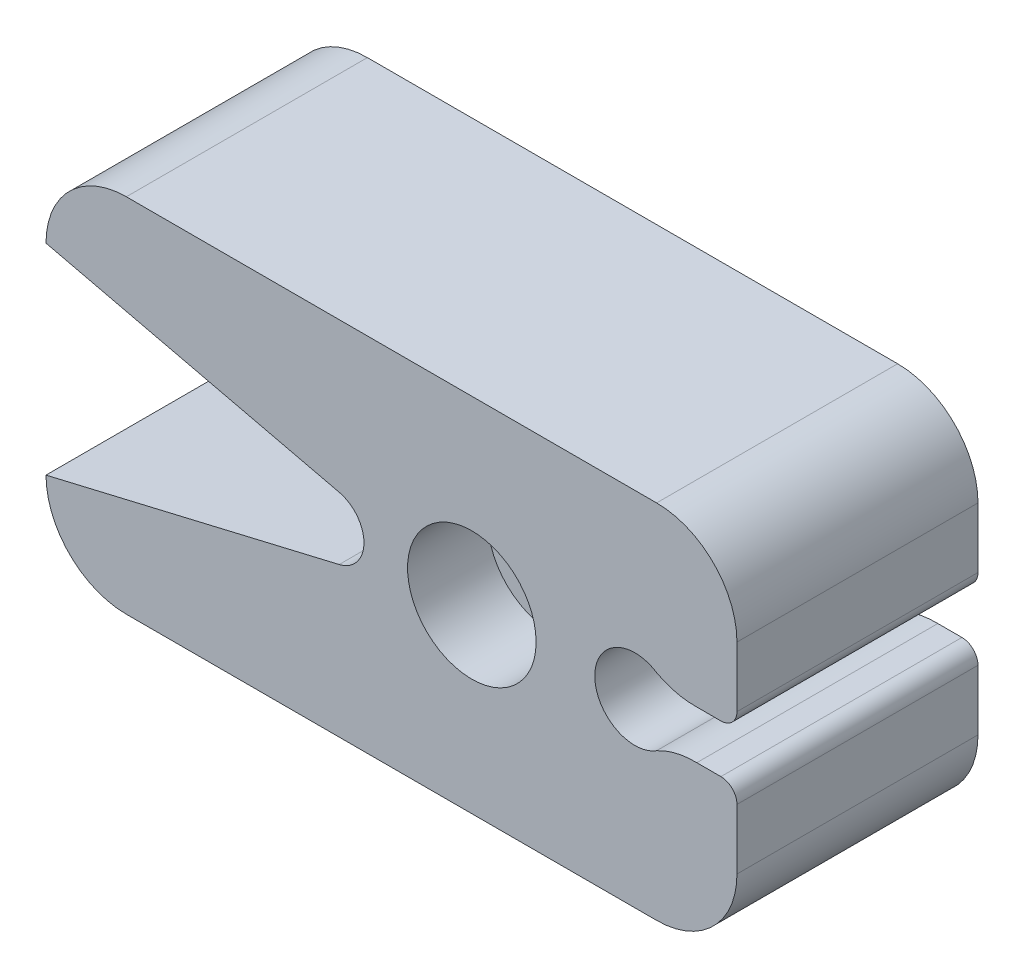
ISO-10303-21;
HEADER;
FILE_DESCRIPTION(('STEP AP214'),'2;1');
FILE_NAME('part.step','',(''),(''),'','','');
FILE_SCHEMA(('AUTOMOTIVE_DESIGN { 1 0 10303 214 1 1 1 1 }'));
ENDSEC;
DATA;
#1=APPLICATION_CONTEXT('core data for automotive mechanical design processes');
#2=APPLICATION_PROTOCOL_DEFINITION('international standard','automotive_design',2000,#1);
#3=PRODUCT_CONTEXT('',#1,'mechanical');
#4=PRODUCT('Part','Part','',(#3));
#5=PRODUCT_RELATED_PRODUCT_CATEGORY('part','',(#4));
#6=PRODUCT_DEFINITION_FORMATION('','',#4);
#7=PRODUCT_DEFINITION_CONTEXT('part definition',#1,'design');
#8=PRODUCT_DEFINITION('design','',#6,#7);
#9=PRODUCT_DEFINITION_SHAPE('','',#8);
#10=(LENGTH_UNIT() NAMED_UNIT(*) SI_UNIT(.MILLI.,.METRE.));
#11=(NAMED_UNIT(*) PLANE_ANGLE_UNIT() SI_UNIT($,.RADIAN.));
#12=(NAMED_UNIT(*) SI_UNIT($,.STERADIAN.) SOLID_ANGLE_UNIT());
#13=UNCERTAINTY_MEASURE_WITH_UNIT(LENGTH_MEASURE(1.E-05),#10,'distance_accuracy_value','');
#14=(GEOMETRIC_REPRESENTATION_CONTEXT(3) GLOBAL_UNCERTAINTY_ASSIGNED_CONTEXT((#13)) GLOBAL_UNIT_ASSIGNED_CONTEXT((#10,
#11,#12)) REPRESENTATION_CONTEXT('',''));
#15=CARTESIAN_POINT('',(0.,0.,0.));
#16=DIRECTION('',(0.,0.,1.));
#17=DIRECTION('',(1.,0.,0.));
#18=AXIS2_PLACEMENT_3D('',#15,#16,#17);
#19=CARTESIAN_POINT('',(33.,45.,30.));
#20=DIRECTION('',(-1.,0.,0.));
#21=DIRECTION('',(0.,0.,1.));
#22=AXIS2_PLACEMENT_3D('',#19,#20,#21);
#23=PLANE('',#22);
#24=DIRECTION('',(0.,1.,0.));
#25=VECTOR('',#24,1.);
#26=CARTESIAN_POINT('',(33.,45.,30.));
#27=LINE('',#26,#25);
#28=CARTESIAN_POINT('',(33.,27.5,30.));
#29=VERTEX_POINT('',#28);
#30=CARTESIAN_POINT('',(33.,35.,30.));
#31=VERTEX_POINT('',#30);
#32=EDGE_CURVE('E215',#29,#31,#27,.T.);
#33=ORIENTED_EDGE('',*,*,#32,.F.);
#34=DIRECTION('',(0.,0.,1.));
#35=VECTOR('',#34,1.);
#36=CARTESIAN_POINT('',(33.,27.5,30.));
#37=LINE('',#36,#35);
#38=CARTESIAN_POINT('',(33.,27.5,0.));
#39=VERTEX_POINT('',#38);
#40=EDGE_CURVE('E10',#29,#39,#37,.F.);
#41=ORIENTED_EDGE('',*,*,#40,.T.);
#42=DIRECTION('',(0.,1.,0.));
#43=VECTOR('',#42,1.);
#44=CARTESIAN_POINT('',(33.,45.,0.));
#45=LINE('',#44,#43);
#46=CARTESIAN_POINT('',(33.,35.,0.));
#47=VERTEX_POINT('',#46);
#48=EDGE_CURVE('E210',#39,#47,#45,.T.);
#49=ORIENTED_EDGE('',*,*,#48,.T.);
#50=DIRECTION('',(0.,0.,-1.));
#51=VECTOR('',#50,1.);
#52=CARTESIAN_POINT('',(33.,35.,30.));
#53=LINE('',#52,#51);
#54=EDGE_CURVE('E249',#47,#31,#53,.F.);
#55=ORIENTED_EDGE('',*,*,#54,.T.);
#56=EDGE_LOOP('',(#33,#41,#49,#55));
#57=FACE_BOUND('',#56,.T.);
#58=ADVANCED_FACE('F16',(#57),#23,.F.);
#59=CARTESIAN_POINT('',(33.,10.,0.));
#60=VERTEX_POINT('',#59);
#61=CARTESIAN_POINT('',(33.,17.5,0.));
#62=VERTEX_POINT('',#61);
#63=EDGE_CURVE('E224',#60,#62,#45,.T.);
#64=ORIENTED_EDGE('',*,*,#63,.T.);
#65=DIRECTION('',(0.,0.,1.));
#66=VECTOR('',#65,1.);
#67=CARTESIAN_POINT('',(33.,17.5,30.));
#68=LINE('',#67,#66);
#69=CARTESIAN_POINT('',(33.,17.5,30.));
#70=VERTEX_POINT('',#69);
#71=EDGE_CURVE('E270',#62,#70,#68,.T.);
#72=ORIENTED_EDGE('',*,*,#71,.T.);
#73=CARTESIAN_POINT('',(33.,10.,30.));
#74=VERTEX_POINT('',#73);
#75=EDGE_CURVE('E217',#74,#70,#27,.T.);
#76=ORIENTED_EDGE('',*,*,#75,.F.);
#77=DIRECTION('',(0.,0.,-1.));
#78=VECTOR('',#77,1.);
#79=CARTESIAN_POINT('',(33.,10.,30.));
#80=LINE('',#79,#78);
#81=EDGE_CURVE('E246',#74,#60,#80,.T.);
#82=ORIENTED_EDGE('',*,*,#81,.T.);
#83=EDGE_LOOP('',(#64,#72,#76,#82));
#84=FACE_BOUND('',#83,.T.);
#85=ADVANCED_FACE('F303',(#84),#23,.F.);
#86=CARTESIAN_POINT('',(-53.,45.,30.));
#87=DIRECTION('',(0.,-1.,0.));
#88=DIRECTION('',(0.,0.,-1.));
#89=AXIS2_PLACEMENT_3D('',#86,#87,#88);
#90=PLANE('',#89);
#91=DIRECTION('',(-1.,0.,0.));
#92=VECTOR('',#91,1.);
#93=CARTESIAN_POINT('',(-53.,45.,30.));
#94=LINE('',#93,#92);
#95=CARTESIAN_POINT('',(23.,45.,30.));
#96=VERTEX_POINT('',#95);
#97=CARTESIAN_POINT('',(-43.,45.,30.));
#98=VERTEX_POINT('',#97);
#99=EDGE_CURVE('E220',#96,#98,#94,.T.);
#100=ORIENTED_EDGE('',*,*,#99,.F.);
#101=DIRECTION('',(0.,0.,-1.));
#102=VECTOR('',#101,1.);
#103=CARTESIAN_POINT('',(23.,45.,30.));
#104=LINE('',#103,#102);
#105=CARTESIAN_POINT('',(23.,45.,0.));
#106=VERTEX_POINT('',#105);
#107=EDGE_CURVE('E233',#96,#106,#104,.T.);
#108=ORIENTED_EDGE('',*,*,#107,.T.);
#109=DIRECTION('',(-1.,0.,0.));
#110=VECTOR('',#109,1.);
#111=CARTESIAN_POINT('',(-53.,45.,0.));
#112=LINE('',#111,#110);
#113=CARTESIAN_POINT('',(-43.,45.,0.));
#114=VERTEX_POINT('',#113);
#115=EDGE_CURVE('E227',#106,#114,#112,.T.);
#116=ORIENTED_EDGE('',*,*,#115,.T.);
#117=DIRECTION('',(0.,0.,-1.));
#118=VECTOR('',#117,1.);
#119=CARTESIAN_POINT('',(-43.,45.,30.));
#120=LINE('',#119,#118);
#121=EDGE_CURVE('E223',#114,#98,#120,.F.);
#122=ORIENTED_EDGE('',*,*,#121,.T.);
#123=EDGE_LOOP('',(#100,#108,#116,#122));
#124=FACE_BOUND('',#123,.T.);
#125=ADVANCED_FACE('F338',(#124),#90,.F.);
#126=CARTESIAN_POINT('',(0.,0.,30.));
#127=DIRECTION('',(0.,1.,0.));
#128=DIRECTION('',(-1.,0.,0.));
#129=AXIS2_PLACEMENT_3D('',#126,#127,#128);
#130=PLANE('',#129);
#131=DIRECTION('',(1.,0.,0.));
#132=VECTOR('',#131,1.);
#133=CARTESIAN_POINT('',(0.,0.,0.));
#134=LINE('',#133,#132);
#135=CARTESIAN_POINT('',(-43.,0.,0.));
#136=VERTEX_POINT('',#135);
#137=CARTESIAN_POINT('',(23.,0.,0.));
#138=VERTEX_POINT('',#137);
#139=EDGE_CURVE('E216',#136,#138,#134,.T.);
#140=ORIENTED_EDGE('',*,*,#139,.T.);
#141=DIRECTION('',(0.,0.,-1.));
#142=VECTOR('',#141,1.);
#143=CARTESIAN_POINT('',(23.,0.,30.));
#144=LINE('',#143,#142);
#145=CARTESIAN_POINT('',(23.,0.,30.));
#146=VERTEX_POINT('',#145);
#147=EDGE_CURVE('E264',#138,#146,#144,.F.);
#148=ORIENTED_EDGE('',*,*,#147,.T.);
#149=DIRECTION('',(1.,0.,0.));
#150=VECTOR('',#149,1.);
#151=CARTESIAN_POINT('',(33.,0.,30.));
#152=LINE('',#151,#150);
#153=CARTESIAN_POINT('',(-43.,0.,30.));
#154=VERTEX_POINT('',#153);
#155=EDGE_CURVE('E212',#154,#146,#152,.T.);
#156=ORIENTED_EDGE('',*,*,#155,.F.);
#157=DIRECTION('',(0.,0.,-1.));
#158=VECTOR('',#157,1.);
#159=CARTESIAN_POINT('',(-43.,0.,30.));
#160=LINE('',#159,#158);
#161=EDGE_CURVE('E261',#154,#136,#160,.T.);
#162=ORIENTED_EDGE('',*,*,#161,.T.);
#163=EDGE_LOOP('',(#140,#148,#156,#162));
#164=FACE_BOUND('',#163,.T.);
#165=ADVANCED_FACE('F312',(#164),#130,.F.);
#166=CARTESIAN_POINT('',(0.,0.,30.));
#167=DIRECTION('',(0.,0.,-1.));
#168=DIRECTION('',(-1.,0.,0.));
#169=AXIS2_PLACEMENT_3D('',#166,#167,#168);
#170=PLANE('',#169);
#171=CARTESIAN_POINT('',(0.,22.5,30.));
#172=DIRECTION('',(0.,0.,1.));
#173=DIRECTION('',(1.,0.,0.));
#174=AXIS2_PLACEMENT_3D('',#171,#172,#173);
#175=CIRCLE('',#174,8.);
#176=CARTESIAN_POINT('',(8.,22.5,30.));
#177=VERTEX_POINT('',#176);
#178=EDGE_CURVE('E169',#177,#177,#175,.T.);
#179=ORIENTED_EDGE('',*,*,#178,.F.);
#180=EDGE_LOOP('',(#179));
#181=FACE_BOUND('',#180,.T.);
#182=ORIENTED_EDGE('',*,*,#75,.T.);
#183=CARTESIAN_POINT('',(31.,17.5,30.));
#184=DIRECTION('',(0.,0.,-1.));
#185=DIRECTION('',(-1.,0.,0.));
#186=AXIS2_PLACEMENT_3D('',#183,#184,#185);
#187=CIRCLE('',#186,2.);
#188=CARTESIAN_POINT('',(31.,19.5,30.));
#189=VERTEX_POINT('',#188);
#190=EDGE_CURVE('E275',#70,#189,#187,.F.);
#191=ORIENTED_EDGE('',*,*,#190,.T.);
#192=DIRECTION('',(1.,0.,0.));
#193=VECTOR('',#192,1.);
#194=CARTESIAN_POINT('',(33.,19.5,30.));
#195=LINE('',#194,#193);
#196=CARTESIAN_POINT('',(28.,19.5,30.));
#197=VERTEX_POINT('',#196);
#198=EDGE_CURVE('E166',#197,#189,#195,.T.);
#199=ORIENTED_EDGE('',*,*,#198,.F.);
#200=CARTESIAN_POINT('',(27.7692667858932,9.50266224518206,30.));
#201=DIRECTION('',(0.,0.,-1.));
#202=DIRECTION('',(-1.,0.,0.));
#203=AXIS2_PLACEMENT_3D('',#200,#201,#202);
#204=CIRCLE('',#203,10.);
#205=CARTESIAN_POINT('',(23.0041823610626,18.2943611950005,30.));
#206=VERTEX_POINT('',#205);
#207=EDGE_CURVE('E180',#206,#197,#204,.T.);
#208=ORIENTED_EDGE('',*,*,#207,.F.);
#209=CARTESIAN_POINT('',(20.3,22.5,30.));
#210=DIRECTION('',(0.,0.,1.));
#211=DIRECTION('',(1.,0.,0.));
#212=AXIS2_PLACEMENT_3D('',#209,#210,#211);
#213=CIRCLE('',#212,5.);
#214=CARTESIAN_POINT('',(23.0041823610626,26.7056388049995,30.));
#215=VERTEX_POINT('',#214);
#216=EDGE_CURVE('E177',#215,#206,#213,.T.);
#217=ORIENTED_EDGE('',*,*,#216,.F.);
#218=CARTESIAN_POINT('',(27.7692667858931,35.4973377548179,30.));
#219=DIRECTION('',(0.,0.,-1.));
#220=DIRECTION('',(1.,0.,0.));
#221=AXIS2_PLACEMENT_3D('',#218,#219,#220);
#222=CIRCLE('',#221,10.);
#223=CARTESIAN_POINT('',(28.,25.5,30.));
#224=VERTEX_POINT('',#223);
#225=EDGE_CURVE('E147',#224,#215,#222,.T.);
#226=ORIENTED_EDGE('',*,*,#225,.F.);
#227=DIRECTION('',(-1.,0.,0.));
#228=VECTOR('',#227,1.);
#229=CARTESIAN_POINT('',(33.,25.5,30.));
#230=LINE('',#229,#228);
#231=CARTESIAN_POINT('',(31.,25.5,30.));
#232=VERTEX_POINT('',#231);
#233=EDGE_CURVE('E164',#232,#224,#230,.T.);
#234=ORIENTED_EDGE('',*,*,#233,.F.);
#235=CARTESIAN_POINT('',(31.,27.5,30.));
#236=DIRECTION('',(0.,0.,-1.));
#237=DIRECTION('',(-1.,0.,0.));
#238=AXIS2_PLACEMENT_3D('',#235,#236,#237);
#239=CIRCLE('',#238,2.);
#240=EDGE_CURVE('E273',#232,#29,#239,.F.);
#241=ORIENTED_EDGE('',*,*,#240,.T.);
#242=ORIENTED_EDGE('',*,*,#32,.T.);
#243=CARTESIAN_POINT('',(23.,35.,30.));
#244=DIRECTION('',(0.,0.,-1.));
#245=DIRECTION('',(-1.,0.,0.));
#246=AXIS2_PLACEMENT_3D('',#243,#244,#245);
#247=CIRCLE('',#246,10.);
#248=EDGE_CURVE('E259',#31,#96,#247,.F.);
#249=ORIENTED_EDGE('',*,*,#248,.T.);
#250=ORIENTED_EDGE('',*,*,#99,.T.);
#251=CARTESIAN_POINT('',(-43.,35.,30.));
#252=DIRECTION('',(0.,0.,-1.));
#253=DIRECTION('',(-1.,0.,0.));
#254=AXIS2_PLACEMENT_3D('',#251,#252,#253);
#255=CIRCLE('',#254,10.);
#256=CARTESIAN_POINT('',(-53.,35.,30.));
#257=VERTEX_POINT('',#256);
#258=EDGE_CURVE('E252',#98,#257,#255,.F.);
#259=ORIENTED_EDGE('',*,*,#258,.T.);
#260=DIRECTION('',(-0.973296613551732,0.229551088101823,0.));
#261=VECTOR('',#260,1.);
#262=CARTESIAN_POINT('',(-53.,35.,30.));
#263=LINE('',#262,#261);
#264=CARTESIAN_POINT('',(-16.5071105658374,26.3931864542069,30.));
#265=VERTEX_POINT('',#264);
#266=EDGE_CURVE('E195',#265,#257,#263,.T.);
#267=ORIENTED_EDGE('',*,*,#266,.F.);
#268=CARTESIAN_POINT('',(-17.4253149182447,22.5,30.));
#269=DIRECTION('',(0.,0.,1.));
#270=DIRECTION('',(1.,0.,0.));
#271=AXIS2_PLACEMENT_3D('',#268,#269,#270);
#272=CIRCLE('',#271,4.);
#273=CARTESIAN_POINT('',(-16.5071105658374,18.606813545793,30.));
#274=VERTEX_POINT('',#273);
#275=EDGE_CURVE('E204',#274,#265,#272,.T.);
#276=ORIENTED_EDGE('',*,*,#275,.F.);
#277=DIRECTION('',(0.973296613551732,0.229551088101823,0.));
#278=VECTOR('',#277,1.);
#279=CARTESIAN_POINT('',(-53.,10.,30.));
#280=LINE('',#279,#278);
#281=CARTESIAN_POINT('',(-53.,10.,30.));
#282=VERTEX_POINT('',#281);
#283=EDGE_CURVE('E187',#282,#274,#280,.T.);
#284=ORIENTED_EDGE('',*,*,#283,.F.);
#285=CARTESIAN_POINT('',(-43.,10.,30.));
#286=DIRECTION('',(0.,0.,-1.));
#287=DIRECTION('',(-1.,0.,0.));
#288=AXIS2_PLACEMENT_3D('',#285,#286,#287);
#289=CIRCLE('',#288,10.);
#290=EDGE_CURVE('E255',#282,#154,#289,.F.);
#291=ORIENTED_EDGE('',*,*,#290,.T.);
#292=ORIENTED_EDGE('',*,*,#155,.T.);
#293=CARTESIAN_POINT('',(23.,10.,30.));
#294=DIRECTION('',(0.,0.,-1.));
#295=DIRECTION('',(-1.,0.,0.));
#296=AXIS2_PLACEMENT_3D('',#293,#294,#295);
#297=CIRCLE('',#296,10.);
#298=EDGE_CURVE('E257',#146,#74,#297,.F.);
#299=ORIENTED_EDGE('',*,*,#298,.T.);
#300=EDGE_LOOP('',(#182,#191,#199,#208,#217,#226,#234,#241,#242,#249,#250,#259,#267,#276,#284,
#291,#292,#299));
#301=FACE_BOUND('',#300,.T.);
#302=ADVANCED_FACE('F288',(#181,#301),#170,.F.);
#303=CARTESIAN_POINT('',(0.,0.,0.));
#304=DIRECTION('',(0.,0.,-1.));
#305=DIRECTION('',(-1.,0.,0.));
#306=AXIS2_PLACEMENT_3D('',#303,#304,#305);
#307=PLANE('',#306);
#308=CARTESIAN_POINT('',(0.,22.5,0.));
#309=DIRECTION('',(0.,0.,1.));
#310=DIRECTION('',(1.,0.,0.));
#311=AXIS2_PLACEMENT_3D('',#308,#309,#310);
#312=CIRCLE('',#311,5.);
#313=CARTESIAN_POINT('',(5.,22.5,0.));
#314=VERTEX_POINT('',#313);
#315=EDGE_CURVE('E545',#314,#314,#312,.T.);
#316=ORIENTED_EDGE('',*,*,#315,.T.);
#317=EDGE_LOOP('',(#316));
#318=FACE_BOUND('',#317,.T.);
#319=DIRECTION('',(1.,0.,0.));
#320=VECTOR('',#319,1.);
#321=CARTESIAN_POINT('',(33.,19.5,0.));
#322=LINE('',#321,#320);
#323=CARTESIAN_POINT('',(28.,19.5,0.));
#324=VERTEX_POINT('',#323);
#325=CARTESIAN_POINT('',(31.,19.5,0.));
#326=VERTEX_POINT('',#325);
#327=EDGE_CURVE('E173',#324,#326,#322,.T.);
#328=ORIENTED_EDGE('',*,*,#327,.T.);
#329=CARTESIAN_POINT('',(31.,17.5,0.));
#330=DIRECTION('',(0.,0.,-1.));
#331=DIRECTION('',(-1.,0.,0.));
#332=AXIS2_PLACEMENT_3D('',#329,#330,#331);
#333=CIRCLE('',#332,2.);
#334=EDGE_CURVE('E280',#326,#62,#333,.T.);
#335=ORIENTED_EDGE('',*,*,#334,.T.);
#336=ORIENTED_EDGE('',*,*,#63,.F.);
#337=CARTESIAN_POINT('',(23.,10.,0.));
#338=DIRECTION('',(0.,0.,-1.));
#339=DIRECTION('',(-1.,0.,0.));
#340=AXIS2_PLACEMENT_3D('',#337,#338,#339);
#341=CIRCLE('',#340,10.);
#342=EDGE_CURVE('E241',#60,#138,#341,.T.);
#343=ORIENTED_EDGE('',*,*,#342,.T.);
#344=ORIENTED_EDGE('',*,*,#139,.F.);
#345=CARTESIAN_POINT('',(-43.,10.,0.));
#346=DIRECTION('',(0.,0.,-1.));
#347=DIRECTION('',(-1.,0.,0.));
#348=AXIS2_PLACEMENT_3D('',#345,#346,#347);
#349=CIRCLE('',#348,10.);
#350=CARTESIAN_POINT('',(-53.,10.,0.));
#351=VERTEX_POINT('',#350);
#352=EDGE_CURVE('E238',#136,#351,#349,.T.);
#353=ORIENTED_EDGE('',*,*,#352,.T.);
#354=DIRECTION('',(0.973296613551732,0.229551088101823,0.));
#355=VECTOR('',#354,1.);
#356=CARTESIAN_POINT('',(-53.,10.,0.));
#357=LINE('',#356,#355);
#358=CARTESIAN_POINT('',(-16.5071105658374,18.606813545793,0.));
#359=VERTEX_POINT('',#358);
#360=EDGE_CURVE('E191',#351,#359,#357,.T.);
#361=ORIENTED_EDGE('',*,*,#360,.T.);
#362=CARTESIAN_POINT('',(-17.4253149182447,22.5,0.));
#363=DIRECTION('',(0.,0.,1.));
#364=DIRECTION('',(1.,0.,0.));
#365=AXIS2_PLACEMENT_3D('',#362,#363,#364);
#366=CIRCLE('',#365,4.);
#367=CARTESIAN_POINT('',(-16.5071105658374,26.3931864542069,0.));
#368=VERTEX_POINT('',#367);
#369=EDGE_CURVE('E194',#359,#368,#366,.T.);
#370=ORIENTED_EDGE('',*,*,#369,.T.);
#371=DIRECTION('',(-0.973296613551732,0.229551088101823,0.));
#372=VECTOR('',#371,1.);
#373=CARTESIAN_POINT('',(-53.,35.,0.));
#374=LINE('',#373,#372);
#375=CARTESIAN_POINT('',(-53.,35.,0.));
#376=VERTEX_POINT('',#375);
#377=EDGE_CURVE('E198',#368,#376,#374,.T.);
#378=ORIENTED_EDGE('',*,*,#377,.T.);
#379=CARTESIAN_POINT('',(-43.,35.,0.));
#380=DIRECTION('',(0.,0.,-1.));
#381=DIRECTION('',(-1.,0.,0.));
#382=AXIS2_PLACEMENT_3D('',#379,#380,#381);
#383=CIRCLE('',#382,10.);
#384=EDGE_CURVE('E236',#376,#114,#383,.T.);
#385=ORIENTED_EDGE('',*,*,#384,.T.);
#386=ORIENTED_EDGE('',*,*,#115,.F.);
#387=CARTESIAN_POINT('',(23.,35.,0.));
#388=DIRECTION('',(0.,0.,-1.));
#389=DIRECTION('',(-1.,0.,0.));
#390=AXIS2_PLACEMENT_3D('',#387,#388,#389);
#391=CIRCLE('',#390,10.);
#392=EDGE_CURVE('E243',#106,#47,#391,.T.);
#393=ORIENTED_EDGE('',*,*,#392,.T.);
#394=ORIENTED_EDGE('',*,*,#48,.F.);
#395=CARTESIAN_POINT('',(31.,27.5,0.));
#396=DIRECTION('',(0.,0.,-1.));
#397=DIRECTION('',(-1.,0.,0.));
#398=AXIS2_PLACEMENT_3D('',#395,#396,#397);
#399=CIRCLE('',#398,2.);
#400=CARTESIAN_POINT('',(31.,25.5,0.));
#401=VERTEX_POINT('',#400);
#402=EDGE_CURVE('E36',#39,#401,#399,.T.);
#403=ORIENTED_EDGE('',*,*,#402,.T.);
#404=DIRECTION('',(-1.,0.,0.));
#405=VECTOR('',#404,1.);
#406=CARTESIAN_POINT('',(33.,25.5,0.));
#407=LINE('',#406,#405);
#408=CARTESIAN_POINT('',(28.,25.5,0.));
#409=VERTEX_POINT('',#408);
#410=EDGE_CURVE('E152',#401,#409,#407,.T.);
#411=ORIENTED_EDGE('',*,*,#410,.T.);
#412=CARTESIAN_POINT('',(27.7692667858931,35.4973377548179,0.));
#413=DIRECTION('',(0.,0.,-1.));
#414=DIRECTION('',(1.,0.,0.));
#415=AXIS2_PLACEMENT_3D('',#412,#413,#414);
#416=CIRCLE('',#415,10.);
#417=CARTESIAN_POINT('',(23.0041823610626,26.7056388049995,0.));
#418=VERTEX_POINT('',#417);
#419=EDGE_CURVE('E145',#409,#418,#416,.T.);
#420=ORIENTED_EDGE('',*,*,#419,.T.);
#421=CARTESIAN_POINT('',(20.3,22.5,0.));
#422=DIRECTION('',(0.,0.,1.));
#423=DIRECTION('',(1.,0.,0.));
#424=AXIS2_PLACEMENT_3D('',#421,#422,#423);
#425=CIRCLE('',#424,5.);
#426=CARTESIAN_POINT('',(23.0041823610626,18.2943611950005,0.));
#427=VERTEX_POINT('',#426);
#428=EDGE_CURVE('E156',#418,#427,#425,.T.);
#429=ORIENTED_EDGE('',*,*,#428,.T.);
#430=CARTESIAN_POINT('',(27.7692667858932,9.50266224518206,0.));
#431=DIRECTION('',(0.,0.,-1.));
#432=DIRECTION('',(-1.,0.,0.));
#433=AXIS2_PLACEMENT_3D('',#430,#431,#432);
#434=CIRCLE('',#433,10.);
#435=EDGE_CURVE('E159',#427,#324,#434,.T.);
#436=ORIENTED_EDGE('',*,*,#435,.T.);
#437=EDGE_LOOP('',(#328,#335,#336,#343,#344,#353,#361,#370,#378,#385,#386,#393,#394,#403,#411,
#420,#429,#436));
#438=FACE_BOUND('',#437,.T.);
#439=ADVANCED_FACE('F162',(#318,#438),#307,.T.);
#440=CARTESIAN_POINT('',(23.,35.,30.));
#441=DIRECTION('',(0.,0.,-1.));
#442=DIRECTION('',(-1.,0.,0.));
#443=AXIS2_PLACEMENT_3D('',#440,#441,#442);
#444=CYLINDRICAL_SURFACE('',#443,10.);
#445=ORIENTED_EDGE('',*,*,#248,.F.);
#446=ORIENTED_EDGE('',*,*,#54,.F.);
#447=ORIENTED_EDGE('',*,*,#392,.F.);
#448=ORIENTED_EDGE('',*,*,#107,.F.);
#449=EDGE_LOOP('',(#445,#446,#447,#448));
#450=FACE_BOUND('',#449,.T.);
#451=ADVANCED_FACE('F343',(#450),#444,.T.);
#452=CARTESIAN_POINT('',(23.,10.,30.));
#453=DIRECTION('',(0.,0.,-1.));
#454=DIRECTION('',(-1.,0.,0.));
#455=AXIS2_PLACEMENT_3D('',#452,#453,#454);
#456=CYLINDRICAL_SURFACE('',#455,10.);
#457=ORIENTED_EDGE('',*,*,#298,.F.);
#458=ORIENTED_EDGE('',*,*,#147,.F.);
#459=ORIENTED_EDGE('',*,*,#342,.F.);
#460=ORIENTED_EDGE('',*,*,#81,.F.);
#461=EDGE_LOOP('',(#457,#458,#459,#460));
#462=FACE_BOUND('',#461,.T.);
#463=ADVANCED_FACE('F309',(#462),#456,.T.);
#464=CARTESIAN_POINT('',(-43.,10.,30.));
#465=DIRECTION('',(0.,0.,-1.));
#466=DIRECTION('',(-1.,0.,0.));
#467=AXIS2_PLACEMENT_3D('',#464,#465,#466);
#468=CYLINDRICAL_SURFACE('',#467,10.);
#469=ORIENTED_EDGE('',*,*,#290,.F.);
#470=DIRECTION('',(0.,0.,-1.));
#471=VECTOR('',#470,1.);
#472=CARTESIAN_POINT('',(-53.,10.,30.));
#473=LINE('',#472,#471);
#474=EDGE_CURVE('E268',#351,#282,#473,.F.);
#475=ORIENTED_EDGE('',*,*,#474,.F.);
#476=ORIENTED_EDGE('',*,*,#352,.F.);
#477=ORIENTED_EDGE('',*,*,#161,.F.);
#478=EDGE_LOOP('',(#469,#475,#476,#477));
#479=FACE_BOUND('',#478,.T.);
#480=ADVANCED_FACE('F316',(#479),#468,.T.);
#481=CARTESIAN_POINT('',(-43.,35.,30.));
#482=DIRECTION('',(0.,0.,-1.));
#483=DIRECTION('',(-1.,0.,0.));
#484=AXIS2_PLACEMENT_3D('',#481,#482,#483);
#485=CYLINDRICAL_SURFACE('',#484,10.);
#486=ORIENTED_EDGE('',*,*,#258,.F.);
#487=ORIENTED_EDGE('',*,*,#121,.F.);
#488=ORIENTED_EDGE('',*,*,#384,.F.);
#489=DIRECTION('',(0.,0.,-1.));
#490=VECTOR('',#489,1.);
#491=CARTESIAN_POINT('',(-53.,35.,30.));
#492=LINE('',#491,#490);
#493=EDGE_CURVE('E266',#257,#376,#492,.T.);
#494=ORIENTED_EDGE('',*,*,#493,.F.);
#495=EDGE_LOOP('',(#486,#487,#488,#494));
#496=FACE_BOUND('',#495,.T.);
#497=ADVANCED_FACE('F335',(#496),#485,.T.);
#498=CARTESIAN_POINT('',(-53.,35.,0.));
#499=DIRECTION('',(0.229551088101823,0.973296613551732,0.));
#500=DIRECTION('',(-0.973296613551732,0.229551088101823,0.));
#501=AXIS2_PLACEMENT_3D('',#498,#499,#500);
#502=PLANE('',#501);
#503=ORIENTED_EDGE('',*,*,#266,.T.);
#504=ORIENTED_EDGE('',*,*,#493,.T.);
#505=ORIENTED_EDGE('',*,*,#377,.F.);
#506=DIRECTION('',(0.,0.,1.));
#507=VECTOR('',#506,1.);
#508=CARTESIAN_POINT('',(-16.5071105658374,26.3931864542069,0.));
#509=LINE('',#508,#507);
#510=EDGE_CURVE('E208',#368,#265,#509,.T.);
#511=ORIENTED_EDGE('',*,*,#510,.T.);
#512=EDGE_LOOP('',(#503,#504,#505,#511));
#513=FACE_BOUND('',#512,.T.);
#514=ADVANCED_FACE('F328',(#513),#502,.F.);
#515=CARTESIAN_POINT('',(-17.4253149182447,22.5,0.));
#516=DIRECTION('',(0.,0.,1.));
#517=DIRECTION('',(1.,0.,0.));
#518=AXIS2_PLACEMENT_3D('',#515,#516,#517);
#519=CYLINDRICAL_SURFACE('',#518,4.);
#520=ORIENTED_EDGE('',*,*,#275,.T.);
#521=ORIENTED_EDGE('',*,*,#510,.F.);
#522=ORIENTED_EDGE('',*,*,#369,.F.);
#523=DIRECTION('',(0.,0.,1.));
#524=VECTOR('',#523,1.);
#525=CARTESIAN_POINT('',(-16.5071105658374,18.606813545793,0.));
#526=LINE('',#525,#524);
#527=EDGE_CURVE('E201',#359,#274,#526,.T.);
#528=ORIENTED_EDGE('',*,*,#527,.T.);
#529=EDGE_LOOP('',(#520,#521,#522,#528));
#530=FACE_BOUND('',#529,.T.);
#531=ADVANCED_FACE('F324',(#530),#519,.F.);
#532=CARTESIAN_POINT('',(-53.,10.,0.));
#533=DIRECTION('',(0.229551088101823,-0.973296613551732,0.));
#534=DIRECTION('',(0.973296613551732,0.229551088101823,0.));
#535=AXIS2_PLACEMENT_3D('',#532,#533,#534);
#536=PLANE('',#535);
#537=ORIENTED_EDGE('',*,*,#283,.T.);
#538=ORIENTED_EDGE('',*,*,#527,.F.);
#539=ORIENTED_EDGE('',*,*,#360,.F.);
#540=ORIENTED_EDGE('',*,*,#474,.T.);
#541=EDGE_LOOP('',(#537,#538,#539,#540));
#542=FACE_BOUND('',#541,.T.);
#543=ADVANCED_FACE('F320',(#542),#536,.F.);
#544=CARTESIAN_POINT('',(27.7692667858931,35.4973377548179,0.));
#545=DIRECTION('',(0.,0.,1.));
#546=DIRECTION('',(1.,0.,0.));
#547=AXIS2_PLACEMENT_3D('',#544,#545,#546);
#548=CYLINDRICAL_SURFACE('',#547,10.);
#549=ORIENTED_EDGE('',*,*,#225,.T.);
#550=DIRECTION('',(0.,0.,1.));
#551=VECTOR('',#550,1.);
#552=CARTESIAN_POINT('',(23.0041823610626,26.7056388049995,0.));
#553=LINE('',#552,#551);
#554=EDGE_CURVE('E140',#418,#215,#553,.T.);
#555=ORIENTED_EDGE('',*,*,#554,.F.);
#556=ORIENTED_EDGE('',*,*,#419,.F.);
#557=DIRECTION('',(0.,0.,1.));
#558=VECTOR('',#557,1.);
#559=CARTESIAN_POINT('',(28.,25.5,0.));
#560=LINE('',#559,#558);
#561=EDGE_CURVE('E185',#409,#224,#560,.T.);
#562=ORIENTED_EDGE('',*,*,#561,.T.);
#563=EDGE_LOOP('',(#549,#555,#556,#562));
#564=FACE_BOUND('',#563,.T.);
#565=ADVANCED_FACE('F142',(#564),#548,.T.);
#566=CARTESIAN_POINT('',(33.,25.5,0.));
#567=DIRECTION('',(0.,1.,0.));
#568=DIRECTION('',(0.,0.,1.));
#569=AXIS2_PLACEMENT_3D('',#566,#567,#568);
#570=PLANE('',#569);
#571=ORIENTED_EDGE('',*,*,#410,.F.);
#572=DIRECTION('',(0.,0.,1.));
#573=VECTOR('',#572,1.);
#574=CARTESIAN_POINT('',(31.,25.5,0.));
#575=LINE('',#574,#573);
#576=EDGE_CURVE('E24',#401,#232,#575,.T.);
#577=ORIENTED_EDGE('',*,*,#576,.T.);
#578=ORIENTED_EDGE('',*,*,#233,.T.);
#579=ORIENTED_EDGE('',*,*,#561,.F.);
#580=EDGE_LOOP('',(#571,#577,#578,#579));
#581=FACE_BOUND('',#580,.T.);
#582=ADVANCED_FACE('F285',(#581),#570,.F.);
#583=CARTESIAN_POINT('',(33.,19.5,0.));
#584=DIRECTION('',(0.,-1.,0.));
#585=DIRECTION('',(1.,0.,0.));
#586=AXIS2_PLACEMENT_3D('',#583,#584,#585);
#587=PLANE('',#586);
#588=ORIENTED_EDGE('',*,*,#198,.T.);
#589=DIRECTION('',(0.,0.,1.));
#590=VECTOR('',#589,1.);
#591=CARTESIAN_POINT('',(31.,19.5,0.));
#592=LINE('',#591,#590);
#593=EDGE_CURVE('E277',#189,#326,#592,.F.);
#594=ORIENTED_EDGE('',*,*,#593,.T.);
#595=ORIENTED_EDGE('',*,*,#327,.F.);
#596=DIRECTION('',(0.,0.,1.));
#597=VECTOR('',#596,1.);
#598=CARTESIAN_POINT('',(28.,19.5,0.));
#599=LINE('',#598,#597);
#600=EDGE_CURVE('E188',#324,#197,#599,.T.);
#601=ORIENTED_EDGE('',*,*,#600,.T.);
#602=EDGE_LOOP('',(#588,#594,#595,#601));
#603=FACE_BOUND('',#602,.T.);
#604=ADVANCED_FACE('F457',(#603),#587,.F.);
#605=CARTESIAN_POINT('',(27.7692667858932,9.50266224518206,0.));
#606=DIRECTION('',(0.,0.,1.));
#607=DIRECTION('',(1.,0.,0.));
#608=AXIS2_PLACEMENT_3D('',#605,#606,#607);
#609=CYLINDRICAL_SURFACE('',#608,10.);
#610=ORIENTED_EDGE('',*,*,#207,.T.);
#611=ORIENTED_EDGE('',*,*,#600,.F.);
#612=ORIENTED_EDGE('',*,*,#435,.F.);
#613=DIRECTION('',(0.,0.,1.));
#614=VECTOR('',#613,1.);
#615=CARTESIAN_POINT('',(23.0041823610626,18.2943611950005,0.));
#616=LINE('',#615,#614);
#617=EDGE_CURVE('E151',#427,#206,#616,.T.);
#618=ORIENTED_EDGE('',*,*,#617,.T.);
#619=EDGE_LOOP('',(#610,#611,#612,#618));
#620=FACE_BOUND('',#619,.T.);
#621=ADVANCED_FACE('F292',(#620),#609,.T.);
#622=CARTESIAN_POINT('',(20.3,22.5,0.));
#623=DIRECTION('',(0.,0.,1.));
#624=DIRECTION('',(1.,0.,0.));
#625=AXIS2_PLACEMENT_3D('',#622,#623,#624);
#626=CYLINDRICAL_SURFACE('',#625,5.);
#627=ORIENTED_EDGE('',*,*,#216,.T.);
#628=ORIENTED_EDGE('',*,*,#617,.F.);
#629=ORIENTED_EDGE('',*,*,#428,.F.);
#630=ORIENTED_EDGE('',*,*,#554,.T.);
#631=EDGE_LOOP('',(#627,#628,#629,#630));
#632=FACE_BOUND('',#631,.T.);
#633=ADVANCED_FACE('F157',(#632),#626,.F.);
#634=CARTESIAN_POINT('',(31.,17.5,30.));
#635=DIRECTION('',(0.,0.,1.));
#636=DIRECTION('',(1.,0.,0.));
#637=AXIS2_PLACEMENT_3D('',#634,#635,#636);
#638=CYLINDRICAL_SURFACE('',#637,2.);
#639=ORIENTED_EDGE('',*,*,#334,.F.);
#640=ORIENTED_EDGE('',*,*,#593,.F.);
#641=ORIENTED_EDGE('',*,*,#190,.F.);
#642=ORIENTED_EDGE('',*,*,#71,.F.);
#643=EDGE_LOOP('',(#639,#640,#641,#642));
#644=FACE_BOUND('',#643,.T.);
#645=ADVANCED_FACE('F300',(#644),#638,.T.);
#646=CARTESIAN_POINT('',(31.,27.5,0.));
#647=DIRECTION('',(0.,0.,1.));
#648=DIRECTION('',(1.,0.,0.));
#649=AXIS2_PLACEMENT_3D('',#646,#647,#648);
#650=CYLINDRICAL_SURFACE('',#649,2.);
#651=ORIENTED_EDGE('',*,*,#402,.F.);
#652=ORIENTED_EDGE('',*,*,#40,.F.);
#653=ORIENTED_EDGE('',*,*,#240,.F.);
#654=ORIENTED_EDGE('',*,*,#576,.F.);
#655=EDGE_LOOP('',(#651,#652,#653,#654));
#656=FACE_BOUND('',#655,.T.);
#657=ADVANCED_FACE('F18',(#656),#650,.T.);
#658=CARTESIAN_POINT('',(0.,22.5,20.));
#659=DIRECTION('',(0.,0.,1.));
#660=DIRECTION('',(1.,0.,0.));
#661=AXIS2_PLACEMENT_3D('',#658,#659,#660);
#662=CYLINDRICAL_SURFACE('',#661,8.);
#663=CARTESIAN_POINT('',(0.,22.5,20.));
#664=DIRECTION('',(0.,0.,1.));
#665=DIRECTION('',(1.,0.,0.));
#666=AXIS2_PLACEMENT_3D('',#663,#664,#665);
#667=CIRCLE('',#666,8.);
#668=CARTESIAN_POINT('',(8.,22.5,20.));
#669=VERTEX_POINT('',#668);
#670=EDGE_CURVE('E178',#669,#669,#667,.T.);
#671=ORIENTED_EDGE('',*,*,#670,.F.);
#672=EDGE_LOOP('',(#671));
#673=FACE_BOUND('',#672,.T.);
#674=ORIENTED_EDGE('',*,*,#178,.T.);
#675=EDGE_LOOP('',(#674));
#676=FACE_BOUND('',#675,.T.);
#677=ADVANCED_FACE('F345',(#673,#676),#662,.F.);
#678=CARTESIAN_POINT('',(0.,22.5,20.));
#679=DIRECTION('',(0.,0.,1.));
#680=DIRECTION('',(1.,0.,0.));
#681=AXIS2_PLACEMENT_3D('',#678,#679,#680);
#682=PLANE('',#681);
#683=CARTESIAN_POINT('',(0.,22.5,20.));
#684=DIRECTION('',(0.,0.,1.));
#685=DIRECTION('',(1.,0.,0.));
#686=AXIS2_PLACEMENT_3D('',#683,#684,#685);
#687=CIRCLE('',#686,5.);
#688=CARTESIAN_POINT('',(5.,22.5,20.));
#689=VERTEX_POINT('',#688);
#690=EDGE_CURVE('E548',#689,#689,#687,.T.);
#691=ORIENTED_EDGE('',*,*,#690,.F.);
#692=EDGE_LOOP('',(#691));
#693=FACE_BOUND('',#692,.T.);
#694=ORIENTED_EDGE('',*,*,#670,.T.);
#695=EDGE_LOOP('',(#694));
#696=FACE_BOUND('',#695,.T.);
#697=ADVANCED_FACE('F352',(#693,#696),#682,.T.);
#698=CARTESIAN_POINT('',(0.,22.5,0.));
#699=DIRECTION('',(0.,0.,1.));
#700=DIRECTION('',(1.,0.,0.));
#701=AXIS2_PLACEMENT_3D('',#698,#699,#700);
#702=CYLINDRICAL_SURFACE('',#701,5.);
#703=ORIENTED_EDGE('',*,*,#315,.F.);
#704=EDGE_LOOP('',(#703));
#705=FACE_BOUND('',#704,.T.);
#706=ORIENTED_EDGE('',*,*,#690,.T.);
#707=EDGE_LOOP('',(#706));
#708=FACE_BOUND('',#707,.T.);
#709=ADVANCED_FACE('F437',(#705,#708),#702,.F.);
#710=CLOSED_SHELL('',(#58,#85,#125,#165,#302,#439,#451,#463,#480,#497,#514,#531,#543,#565,#582,
#604,#621,#633,#645,#657,#677,#697,#709));
#711=MANIFOLD_SOLID_BREP('B1',#710);
#712=ADVANCED_BREP_SHAPE_REPRESENTATION('',(#18,#711),#14);
#713=SHAPE_DEFINITION_REPRESENTATION(#9,#712);
ENDSEC;
END-ISO-10303-21;
